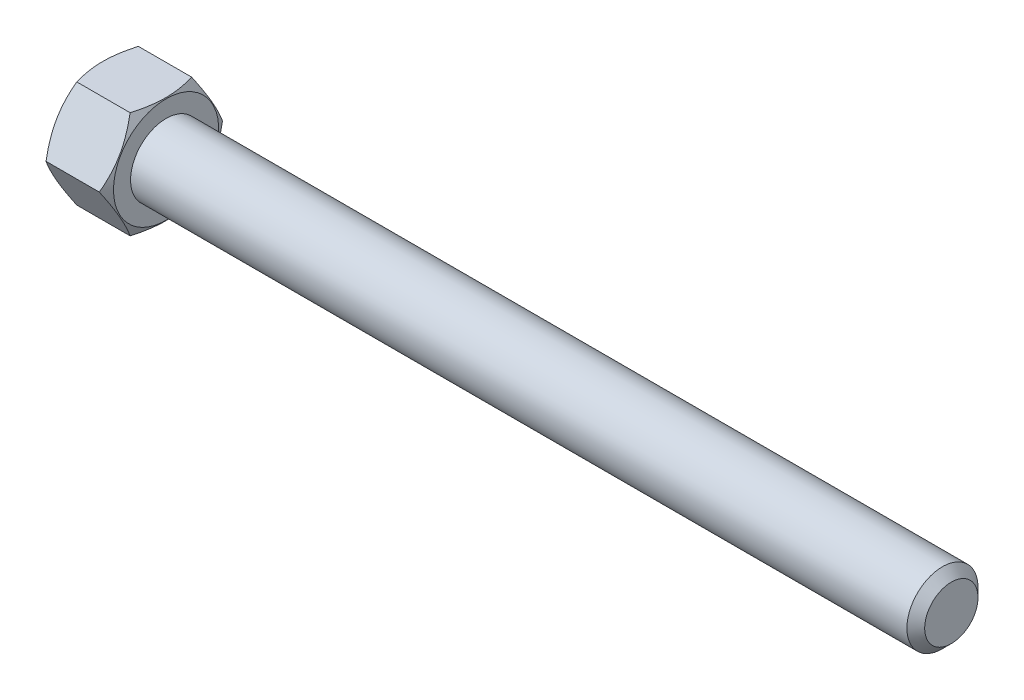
ISO-10303-21;
HEADER;
FILE_DESCRIPTION(('STEP AP214'),'2;1');
FILE_NAME('part.step','',(''),(''),'','','');
FILE_SCHEMA(('AUTOMOTIVE_DESIGN { 1 0 10303 214 1 1 1 1 }'));
ENDSEC;
DATA;
#1=APPLICATION_CONTEXT('core data for automotive mechanical design processes');
#2=APPLICATION_PROTOCOL_DEFINITION('international standard','automotive_design',2000,#1);
#3=PRODUCT_CONTEXT('',#1,'mechanical');
#4=PRODUCT('Part','Part','',(#3));
#5=PRODUCT_RELATED_PRODUCT_CATEGORY('part','',(#4));
#6=PRODUCT_DEFINITION_FORMATION('','',#4);
#7=PRODUCT_DEFINITION_CONTEXT('part definition',#1,'design');
#8=PRODUCT_DEFINITION('design','',#6,#7);
#9=PRODUCT_DEFINITION_SHAPE('','',#8);
#10=(LENGTH_UNIT() NAMED_UNIT(*) SI_UNIT(.MILLI.,.METRE.));
#11=(NAMED_UNIT(*) PLANE_ANGLE_UNIT() SI_UNIT($,.RADIAN.));
#12=(NAMED_UNIT(*) SI_UNIT($,.STERADIAN.) SOLID_ANGLE_UNIT());
#13=UNCERTAINTY_MEASURE_WITH_UNIT(LENGTH_MEASURE(1.E-05),#10,'distance_accuracy_value','');
#14=(GEOMETRIC_REPRESENTATION_CONTEXT(3) GLOBAL_UNCERTAINTY_ASSIGNED_CONTEXT((#13)) GLOBAL_UNIT_ASSIGNED_CONTEXT((#10,
#11,#12)) REPRESENTATION_CONTEXT('',''));
#15=CARTESIAN_POINT('',(0.,0.,0.));
#16=DIRECTION('',(0.,0.,1.));
#17=DIRECTION('',(1.,0.,0.));
#18=AXIS2_PLACEMENT_3D('',#15,#16,#17);
#19=CARTESIAN_POINT('',(21.5,-18.,10.3923048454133));
#20=DIRECTION('',(0.,-0.5,0.866025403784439));
#21=DIRECTION('',(0.,-0.866025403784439,-0.5));
#22=AXIS2_PLACEMENT_3D('',#19,#20,#21);
#23=PLANE('',#22);
#24=DIRECTION('',(-1.,0.,0.));
#25=VECTOR('',#24,1.);
#26=CARTESIAN_POINT('',(21.5,-18.,10.3923048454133));
#27=LINE('',#26,#25);
#28=CARTESIAN_POINT('',(19.75,-18.,10.3923048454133));
#29=VERTEX_POINT('',#28);
#30=CARTESIAN_POINT('',(1.75,-18.,10.3923048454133));
#31=VERTEX_POINT('',#30);
#32=EDGE_CURVE('E12',#29,#31,#27,.T.);
#33=ORIENTED_EDGE('',*,*,#32,.F.);
#34=CARTESIAN_POINT('',(19.7499333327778,-18.0002,10.3921893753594));
#35=CARTESIAN_POINT('',(19.8818017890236,-17.6045674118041,10.6206079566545));
#36=CARTESIAN_POINT('',(20.0076862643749,-17.2073916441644,10.8499174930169));
#37=CARTESIAN_POINT('',(20.2458239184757,-16.4098552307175,11.310375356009));
#38=CARTESIAN_POINT('',(20.3580726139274,-16.0094935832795,11.5415242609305));
#39=CARTESIAN_POINT('',(20.5674298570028,-15.2048116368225,12.0061075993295));
#40=CARTESIAN_POINT('',(20.6645025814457,-14.8004842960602,12.2395460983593));
#41=CARTESIAN_POINT('',(20.8414234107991,-13.9890201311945,12.7080451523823));
#42=CARTESIAN_POINT('',(20.921272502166,-13.5818834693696,12.9431056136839));
#43=CARTESIAN_POINT('',(21.0603498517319,-12.7752328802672,13.4088255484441));
#44=CARTESIAN_POINT('',(21.1200384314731,-12.3757788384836,13.6394504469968));
#45=CARTESIAN_POINT('',(21.2201227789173,-11.5750403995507,14.1017570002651));
#46=CARTESIAN_POINT('',(21.2605181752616,-11.1737559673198,14.3334386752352));
#47=CARTESIAN_POINT('',(21.3209961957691,-10.3705130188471,14.7971912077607));
#48=CARTESIAN_POINT('',(21.3411029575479,-9.96855587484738,15.0292612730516));
#49=CARTESIAN_POINT('',(21.3605713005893,-9.16427056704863,15.4936156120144));
#50=CARTESIAN_POINT('',(21.3599335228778,-8.76194241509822,15.7258998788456));
#51=CARTESIAN_POINT('',(21.3393615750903,-8.0097806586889,16.1601606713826));
#52=CARTESIAN_POINT('',(21.3219359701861,-7.65989346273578,16.3621681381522));
#53=CARTESIAN_POINT('',(21.2717260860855,-6.96095368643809,16.765701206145));
#54=CARTESIAN_POINT('',(21.2389420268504,-6.61190109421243,16.9672268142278));
#55=CARTESIAN_POINT('',(21.158584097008,-5.91476277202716,17.3697198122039));
#56=CARTESIAN_POINT('',(21.1109968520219,-5.56667820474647,17.5706865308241));
#57=CARTESIAN_POINT('',(21.0018722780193,-4.87216610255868,17.9716632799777));
#58=CARTESIAN_POINT('',(20.9403350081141,-4.52573856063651,18.1716733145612));
#59=CARTESIAN_POINT('',(20.7332330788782,-3.47411308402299,18.7788295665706));
#60=CARTESIAN_POINT('',(20.5670176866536,-2.77196054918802,19.1842175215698));
#61=CARTESIAN_POINT('',(20.1897769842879,-1.37812528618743,19.9889486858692));
#62=CARTESIAN_POINT('',(19.978840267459,-0.686424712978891,20.3883021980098));
#63=CARTESIAN_POINT('',(19.7499333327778,0.000199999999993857,20.7847251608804));
#64=B_SPLINE_CURVE_WITH_KNOTS('',3,(#34,#35,#36,#37,#38,#39,#40,#41,#42,#43,#44,#45,#46,#47,#48,
#49,#50,#51,#52,#53,#54,#55,#56,#57,#58,#59,#60,#61,#62,#63),.UNSPECIFIED.,.F.,.F.,(4,2,2,2,2,2,
2,2,2,2,2,2,2,2,4),(0.,1.42650335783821,2.85347447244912,4.28376471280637,5.71397301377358,
7.10888071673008,8.50381526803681,9.8970882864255,11.2903182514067,12.5031974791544,
13.7160593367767,14.9300201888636,16.1439758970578,18.6253607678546,21.1018751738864),.UNSPECIFIED.);
#65=CARTESIAN_POINT('',(19.75,0.,20.7846096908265));
#66=VERTEX_POINT('',#65);
#67=EDGE_CURVE('E100',#29,#66,#64,.T.);
#68=ORIENTED_EDGE('',*,*,#67,.T.);
#69=DIRECTION('',(-1.,0.,0.));
#70=VECTOR('',#69,1.);
#71=CARTESIAN_POINT('',(21.5,0.,20.7846096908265));
#72=LINE('',#71,#70);
#73=CARTESIAN_POINT('',(1.74999999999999,0.,20.7846096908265));
#74=VERTEX_POINT('',#73);
#75=EDGE_CURVE('E70',#66,#74,#72,.T.);
#76=ORIENTED_EDGE('',*,*,#75,.T.);
#77=CARTESIAN_POINT('',(1.75006666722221,0.000199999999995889,20.7847251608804));
#78=CARTESIAN_POINT('',(1.6181982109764,-0.395432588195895,20.5563065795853));
#79=CARTESIAN_POINT('',(1.49231373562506,-0.792608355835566,20.3269970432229));
#80=CARTESIAN_POINT('',(1.25417608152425,-1.59014476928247,19.8665391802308));
#81=CARTESIAN_POINT('',(1.1419273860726,-1.99050641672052,19.6353902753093));
#82=CARTESIAN_POINT('',(0.93257014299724,-2.79518836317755,19.1708069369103));
#83=CARTESIAN_POINT('',(0.835497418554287,-3.19951570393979,18.9373684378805));
#84=CARTESIAN_POINT('',(0.65857658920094,-4.01097986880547,18.4688693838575));
#85=CARTESIAN_POINT('',(0.578727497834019,-4.41811653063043,18.2338089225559));
#86=CARTESIAN_POINT('',(0.439650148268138,-5.22476711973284,17.7680889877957));
#87=CARTESIAN_POINT('',(0.379961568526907,-5.62422116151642,17.537464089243));
#88=CARTESIAN_POINT('',(0.27987722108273,-6.42495960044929,17.0751575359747));
#89=CARTESIAN_POINT('',(0.239481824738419,-6.82624403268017,16.8434758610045));
#90=CARTESIAN_POINT('',(0.179003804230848,-7.62948698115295,16.3797233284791));
#91=CARTESIAN_POINT('',(0.158897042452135,-8.03144412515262,16.1476532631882));
#92=CARTESIAN_POINT('',(0.139428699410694,-8.83572943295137,15.6832989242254));
#93=CARTESIAN_POINT('',(0.14006647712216,-9.23805758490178,15.4510146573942));
#94=CARTESIAN_POINT('',(0.160638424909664,-9.99021934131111,15.0167538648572));
#95=CARTESIAN_POINT('',(0.178064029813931,-10.3401065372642,14.8147463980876));
#96=CARTESIAN_POINT('',(0.228273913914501,-11.0390463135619,14.4112133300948));
#97=CARTESIAN_POINT('',(0.261057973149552,-11.3880989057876,14.209687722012));
#98=CARTESIAN_POINT('',(0.341415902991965,-12.0852372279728,13.8071947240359));
#99=CARTESIAN_POINT('',(0.38900314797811,-12.4333217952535,13.6062280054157));
#100=CARTESIAN_POINT('',(0.49812772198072,-13.1278338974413,13.2052512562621));
#101=CARTESIAN_POINT('',(0.559664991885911,-13.4742614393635,13.0052412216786));
#102=CARTESIAN_POINT('',(0.766766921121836,-14.525886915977,12.3980849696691));
#103=CARTESIAN_POINT('',(0.932982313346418,-15.228039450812,11.99269701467));
#104=CARTESIAN_POINT('',(1.31022301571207,-16.6218747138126,11.1879658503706));
#105=CARTESIAN_POINT('',(1.52115973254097,-17.3135752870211,10.78861233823));
#106=CARTESIAN_POINT('',(1.75006666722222,-18.0002,10.3921893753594));
#107=B_SPLINE_CURVE_WITH_KNOTS('',3,(#77,#78,#79,#80,#81,#82,#83,#84,#85,#86,#87,#88,#89,#90,
#91,#92,#93,#94,#95,#96,#97,#98,#99,#100,#101,#102,#103,#104,#105,#106),.UNSPECIFIED.,.F.,.F.,
(4,2,2,2,2,2,2,2,2,2,2,2,2,2,4),(0.,1.42650335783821,2.85347447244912,4.28376471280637,
5.71397301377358,7.10888071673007,8.5038152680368,9.89708828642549,11.2903182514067,
12.5031974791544,13.7160593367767,14.9300201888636,16.1439758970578,18.6253607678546,
21.1018751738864),.UNSPECIFIED.);
#108=EDGE_CURVE('E115',#74,#31,#107,.T.);
#109=ORIENTED_EDGE('',*,*,#108,.T.);
#110=EDGE_LOOP('',(#33,#68,#76,#109));
#111=FACE_BOUND('',#110,.T.);
#112=ADVANCED_FACE('F45',(#111),#23,.T.);
#113=CARTESIAN_POINT('',(21.5,-18.,-10.3923048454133));
#114=DIRECTION('',(0.,-1.,0.));
#115=DIRECTION('',(0.,0.,-1.));
#116=AXIS2_PLACEMENT_3D('',#113,#114,#115);
#117=PLANE('',#116);
#118=DIRECTION('',(-1.,0.,0.));
#119=VECTOR('',#118,1.);
#120=CARTESIAN_POINT('',(21.5,-18.,-10.3923048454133));
#121=LINE('',#120,#119);
#122=CARTESIAN_POINT('',(19.75,-18.,-10.3923048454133));
#123=VERTEX_POINT('',#122);
#124=CARTESIAN_POINT('',(1.75,-18.,-10.3923048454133));
#125=VERTEX_POINT('',#124);
#126=EDGE_CURVE('E54',#123,#125,#121,.T.);
#127=ORIENTED_EDGE('',*,*,#126,.F.);
#128=CARTESIAN_POINT('',(12.7537522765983,-18.,-27.5421909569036));
#129=CARTESIAN_POINT('',(12.9446772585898,-18.,-27.1471314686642));
#130=CARTESIAN_POINT('',(13.1346125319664,-18.,-26.7515939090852));
#131=CARTESIAN_POINT('',(13.5122764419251,-18.,-25.9594616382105));
#132=CARTESIAN_POINT('',(13.7000050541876,-18.,-25.5628669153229));
#133=CARTESIAN_POINT('',(14.2595945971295,-18.,-24.371229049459));
#134=CARTESIAN_POINT('',(14.6277968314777,-18.,-23.5744609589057));
#135=CARTESIAN_POINT('',(15.354174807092,-18.,-21.9708426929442));
#136=CARTESIAN_POINT('',(15.7122809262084,-18.,-21.1639609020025));
#137=CARTESIAN_POINT('',(16.4130893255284,-18.,-19.5435589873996));
#138=CARTESIAN_POINT('',(16.7557924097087,-18.,-18.7300392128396));
#139=CARTESIAN_POINT('',(17.4257190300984,-18.,-17.0850605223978));
#140=CARTESIAN_POINT('',(17.7527035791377,-18.,-16.2535037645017));
#141=CARTESIAN_POINT('',(18.3810151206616,-18.,-14.5805692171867));
#142=CARTESIAN_POINT('',(18.6823392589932,-18.,-13.7391903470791));
#143=CARTESIAN_POINT('',(19.251215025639,-18.,-12.0470354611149));
#144=CARTESIAN_POINT('',(19.5188386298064,-18.,-11.1962838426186));
#145=CARTESIAN_POINT('',(20.0116221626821,-18.,-9.48260466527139));
#146=CARTESIAN_POINT('',(20.2367955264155,-18.,-8.61968105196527));
#147=CARTESIAN_POINT('',(20.5344662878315,-18.,-7.3160012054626));
#148=CARTESIAN_POINT('',(20.6270242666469,-18.,-6.87979525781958));
#149=CARTESIAN_POINT('',(20.7973129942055,-18.,-6.00448416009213));
#150=CARTESIAN_POINT('',(20.8750440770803,-18.,-5.565379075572));
#151=CARTESIAN_POINT('',(21.0142998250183,-18.,-4.68456586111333));
#152=CARTESIAN_POINT('',(21.0758234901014,-18.,-4.24285757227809));
#153=CARTESIAN_POINT('',(21.1814280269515,-18.,-3.35734567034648));
#154=CARTESIAN_POINT('',(21.2255088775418,-18.,-2.91354205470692));
#155=CARTESIAN_POINT('',(21.2950421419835,-18.,-2.0272925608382));
#156=CARTESIAN_POINT('',(21.3206106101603,-18.,-1.58485584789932));
#157=CARTESIAN_POINT('',(21.3529849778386,-18.,-0.699298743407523));
#158=CARTESIAN_POINT('',(21.3597911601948,-18.,-0.256178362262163));
#159=CARTESIAN_POINT('',(21.3544796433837,-18.,0.629828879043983));
#160=CARTESIAN_POINT('',(21.3423671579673,-18.,1.07271576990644));
#161=CARTESIAN_POINT('',(21.2995189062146,-18.,1.95758964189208));
#162=CARTESIAN_POINT('',(21.2687823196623,-18.,2.39957658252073));
#163=CARTESIAN_POINT('',(21.1723280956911,-18.,3.47112769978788));
#164=CARTESIAN_POINT('',(21.0972625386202,-18.,4.09986678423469));
#165=CARTESIAN_POINT('',(20.9136280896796,-18.,5.35240621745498));
#166=CARTESIAN_POINT('',(20.8050542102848,-18.,5.97620581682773));
#167=CARTESIAN_POINT('',(20.4345174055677,-18.,7.84129017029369));
#168=CARTESIAN_POINT('',(20.1279866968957,-18.,9.07382231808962));
#169=CARTESIAN_POINT('',(19.5995943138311,-18.,10.9174460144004));
#170=CARTESIAN_POINT('',(19.4094517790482,-18.,11.5381742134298));
#171=CARTESIAN_POINT('',(19.0102504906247,-18.,12.7736336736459));
#172=CARTESIAN_POINT('',(18.8011900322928,-18.,13.3883643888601));
#173=CARTESIAN_POINT('',(18.3686043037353,-18.,14.6087639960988));
#174=CARTESIAN_POINT('',(18.1451673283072,-18.,15.214464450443));
#175=CARTESIAN_POINT('',(17.8003584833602,-18.,16.1192027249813));
#176=CARTESIAN_POINT('',(17.6838330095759,-18.,16.4200981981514));
#177=CARTESIAN_POINT('',(17.4478255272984,-18.,17.0207210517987));
#178=CARTESIAN_POINT('',(17.3283435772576,-18.,17.3204484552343));
#179=CARTESIAN_POINT('',(17.2075168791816,-18.,17.6196324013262));
#180=B_SPLINE_CURVE_WITH_KNOTS('',3,(#128,#129,#130,#131,#132,#133,#134,#135,#136,#137,#138,
#139,#140,#141,#142,#143,#144,#145,#146,#147,#148,#149,#150,#151,#152,#153,#154,#155,#156,#157,
#158,#159,#160,#161,#162,#163,#164,#165,#166,#167,#168,#169,#170,#171,#172,#173,#174,#175,#176,
#177,#178,#179),.UNSPECIFIED.,.F.,.F.,(4,2,2,2,2,2,2,2,2,2,2,2,2,2,2,2,2,2,2,2,2,2,2,2,2,4),(0.,
1.31632532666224,2.6326651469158,5.26577398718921,7.91398554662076,10.562058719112,
13.2423415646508,15.9229221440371,18.5976769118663,21.2715837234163,22.609125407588,
23.9466369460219,25.2842309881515,26.6218266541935,27.950962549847,29.2800784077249,
30.6088280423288,31.9376362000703,33.8361701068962,35.7349867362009,39.5399393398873,
41.4873802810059,43.4349968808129,45.3716216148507,46.3396196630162,47.3075985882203),.UNSPECIFIED.);
#181=EDGE_CURVE('E108',#123,#29,#180,.T.);
#182=ORIENTED_EDGE('',*,*,#181,.T.);
#183=ORIENTED_EDGE('',*,*,#32,.T.);
#184=CARTESIAN_POINT('',(8.74624772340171,-18.,-27.5421909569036));
#185=CARTESIAN_POINT('',(8.55532274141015,-18.,-27.1471314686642));
#186=CARTESIAN_POINT('',(8.3653874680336,-18.,-26.7515939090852));
#187=CARTESIAN_POINT('',(7.98772355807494,-18.,-25.9594616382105));
#188=CARTESIAN_POINT('',(7.79999494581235,-18.,-25.5628669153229));
#189=CARTESIAN_POINT('',(7.24040540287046,-18.,-24.371229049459));
#190=CARTESIAN_POINT('',(6.87220316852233,-18.,-23.5744609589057));
#191=CARTESIAN_POINT('',(6.145825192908,-18.,-21.9708426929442));
#192=CARTESIAN_POINT('',(5.78771907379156,-18.,-21.1639609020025));
#193=CARTESIAN_POINT('',(5.08691067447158,-18.,-19.5435589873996));
#194=CARTESIAN_POINT('',(4.74420759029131,-18.,-18.7300392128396));
#195=CARTESIAN_POINT('',(4.0742809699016,-18.,-17.0850605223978));
#196=CARTESIAN_POINT('',(3.74729642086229,-18.,-16.2535037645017));
#197=CARTESIAN_POINT('',(3.11898487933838,-18.,-14.5805692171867));
#198=CARTESIAN_POINT('',(2.81766074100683,-18.,-13.7391903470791));
#199=CARTESIAN_POINT('',(2.24878497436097,-18.,-12.0470354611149));
#200=CARTESIAN_POINT('',(1.98116137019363,-18.,-11.1962838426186));
#201=CARTESIAN_POINT('',(1.48837783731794,-18.,-9.48260466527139));
#202=CARTESIAN_POINT('',(1.26320447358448,-18.,-8.61968105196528));
#203=CARTESIAN_POINT('',(0.965533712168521,-18.,-7.3160012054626));
#204=CARTESIAN_POINT('',(0.872975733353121,-18.,-6.87979525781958));
#205=CARTESIAN_POINT('',(0.702687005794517,-18.,-6.00448416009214));
#206=CARTESIAN_POINT('',(0.624955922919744,-18.,-5.565379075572));
#207=CARTESIAN_POINT('',(0.485700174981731,-18.,-4.68456586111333));
#208=CARTESIAN_POINT('',(0.424176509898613,-18.,-4.24285757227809));
#209=CARTESIAN_POINT('',(0.318571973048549,-18.,-3.35734567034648));
#210=CARTESIAN_POINT('',(0.274491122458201,-18.,-2.91354205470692));
#211=CARTESIAN_POINT('',(0.204957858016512,-18.,-2.02729256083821));
#212=CARTESIAN_POINT('',(0.179389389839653,-18.,-1.58485584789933));
#213=CARTESIAN_POINT('',(0.147015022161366,-18.,-0.699298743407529));
#214=CARTESIAN_POINT('',(0.140208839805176,-18.,-0.256178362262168));
#215=CARTESIAN_POINT('',(0.14552035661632,-18.,0.62982887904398));
#216=CARTESIAN_POINT('',(0.157632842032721,-18.,1.07271576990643));
#217=CARTESIAN_POINT('',(0.200481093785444,-18.,1.95758964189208));
#218=CARTESIAN_POINT('',(0.231217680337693,-18.,2.39957658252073));
#219=CARTESIAN_POINT('',(0.327671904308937,-18.,3.47112769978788));
#220=CARTESIAN_POINT('',(0.402737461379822,-18.,4.09986678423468));
#221=CARTESIAN_POINT('',(0.586371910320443,-18.,5.35240621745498));
#222=CARTESIAN_POINT('',(0.694945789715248,-18.,5.97620581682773));
#223=CARTESIAN_POINT('',(1.06548259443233,-18.,7.84129017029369));
#224=CARTESIAN_POINT('',(1.3720133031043,-18.,9.07382231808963));
#225=CARTESIAN_POINT('',(1.90040568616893,-18.,10.9174460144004));
#226=CARTESIAN_POINT('',(2.09054822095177,-18.,11.5381742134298));
#227=CARTESIAN_POINT('',(2.48974950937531,-18.,12.773633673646));
#228=CARTESIAN_POINT('',(2.69880996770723,-18.,13.3883643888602));
#229=CARTESIAN_POINT('',(3.13139569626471,-18.,14.6087639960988));
#230=CARTESIAN_POINT('',(3.35483267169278,-18.,15.214464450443));
#231=CARTESIAN_POINT('',(3.69964151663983,-18.,16.1192027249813));
#232=CARTESIAN_POINT('',(3.81616699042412,-18.,16.4200981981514));
#233=CARTESIAN_POINT('',(4.05217447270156,-18.,17.0207210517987));
#234=CARTESIAN_POINT('',(4.17165642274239,-18.,17.3204484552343));
#235=CARTESIAN_POINT('',(4.29248312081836,-18.,17.6196324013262));
#236=B_SPLINE_CURVE_WITH_KNOTS('',3,(#184,#185,#186,#187,#188,#189,#190,#191,#192,#193,#194,
#195,#196,#197,#198,#199,#200,#201,#202,#203,#204,#205,#206,#207,#208,#209,#210,#211,#212,#213,
#214,#215,#216,#217,#218,#219,#220,#221,#222,#223,#224,#225,#226,#227,#228,#229,#230,#231,#232,
#233,#234,#235),.UNSPECIFIED.,.F.,.F.,(4,2,2,2,2,2,2,2,2,2,2,2,2,2,2,2,2,2,2,2,2,2,2,2,2,4),(0.,
1.31632532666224,2.6326651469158,5.2657739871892,7.91398554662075,10.562058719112,
13.2423415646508,15.9229221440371,18.5976769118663,21.2715837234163,22.609125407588,
23.9466369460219,25.2842309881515,26.6218266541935,27.950962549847,29.2800784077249,
30.6088280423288,31.9376362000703,33.8361701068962,35.7349867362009,39.5399393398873,
41.4873802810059,43.4349968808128,45.3716216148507,46.3396196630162,47.3075985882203),.UNSPECIFIED.);
#237=EDGE_CURVE('E118',#31,#125,#236,.F.);
#238=ORIENTED_EDGE('',*,*,#237,.T.);
#239=EDGE_LOOP('',(#127,#182,#183,#238));
#240=FACE_BOUND('',#239,.T.);
#241=ADVANCED_FACE('F176',(#240),#117,.T.);
#242=CARTESIAN_POINT('',(21.5,0.,-20.7846096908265));
#243=DIRECTION('',(0.,-0.5,-0.866025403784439));
#244=DIRECTION('',(0.,0.866025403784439,-0.5));
#245=AXIS2_PLACEMENT_3D('',#242,#243,#244);
#246=PLANE('',#245);
#247=DIRECTION('',(-1.,0.,0.));
#248=VECTOR('',#247,1.);
#249=CARTESIAN_POINT('',(21.5,0.,-20.7846096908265));
#250=LINE('',#249,#248);
#251=CARTESIAN_POINT('',(19.75,0.,-20.7846096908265));
#252=VERTEX_POINT('',#251);
#253=CARTESIAN_POINT('',(1.75,0.,-20.7846096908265));
#254=VERTEX_POINT('',#253);
#255=EDGE_CURVE('E122',#252,#254,#250,.T.);
#256=ORIENTED_EDGE('',*,*,#255,.F.);
#257=CARTESIAN_POINT('',(19.7499333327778,0.000199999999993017,-20.7847251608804));
#258=CARTESIAN_POINT('',(19.8818017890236,-0.395432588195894,-20.5563065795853));
#259=CARTESIAN_POINT('',(20.0076862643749,-0.792608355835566,-20.3269970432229));
#260=CARTESIAN_POINT('',(20.2458239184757,-1.59014476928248,-19.8665391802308));
#261=CARTESIAN_POINT('',(20.3580726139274,-1.99050641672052,-19.6353902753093));
#262=CARTESIAN_POINT('',(20.5674298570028,-2.79518836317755,-19.1708069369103));
#263=CARTESIAN_POINT('',(20.6645025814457,-3.19951570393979,-18.9373684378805));
#264=CARTESIAN_POINT('',(20.841423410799,-4.01097986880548,-18.4688693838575));
#265=CARTESIAN_POINT('',(20.921272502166,-4.41811653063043,-18.2338089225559));
#266=CARTESIAN_POINT('',(21.0603498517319,-5.22476711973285,-17.7680889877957));
#267=CARTESIAN_POINT('',(21.1200384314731,-5.62422116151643,-17.537464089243));
#268=CARTESIAN_POINT('',(21.2201227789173,-6.42495960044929,-17.0751575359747));
#269=CARTESIAN_POINT('',(21.2605181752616,-6.82624403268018,-16.8434758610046));
#270=CARTESIAN_POINT('',(21.3209961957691,-7.62948698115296,-16.3797233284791));
#271=CARTESIAN_POINT('',(21.3411029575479,-8.03144412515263,-16.1476532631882));
#272=CARTESIAN_POINT('',(21.3605713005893,-8.83572943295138,-15.6832989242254));
#273=CARTESIAN_POINT('',(21.3599335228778,-9.23805758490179,-15.4510146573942));
#274=CARTESIAN_POINT('',(21.3393615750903,-9.99021934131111,-15.0167538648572));
#275=CARTESIAN_POINT('',(21.3219359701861,-10.3401065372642,-14.8147463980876));
#276=CARTESIAN_POINT('',(21.2717260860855,-11.0390463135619,-14.4112133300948));
#277=CARTESIAN_POINT('',(21.2389420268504,-11.3880989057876,-14.209687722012));
#278=CARTESIAN_POINT('',(21.158584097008,-12.0852372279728,-13.8071947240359));
#279=CARTESIAN_POINT('',(21.1109968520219,-12.4333217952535,-13.6062280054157));
#280=CARTESIAN_POINT('',(21.0018722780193,-13.1278338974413,-13.2052512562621));
#281=CARTESIAN_POINT('',(20.9403350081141,-13.4742614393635,-13.0052412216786));
#282=CARTESIAN_POINT('',(20.7332330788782,-14.525886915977,-12.3980849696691));
#283=CARTESIAN_POINT('',(20.5670176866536,-15.228039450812,-11.99269701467));
#284=CARTESIAN_POINT('',(20.1897769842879,-16.6218747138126,-11.1879658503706));
#285=CARTESIAN_POINT('',(19.978840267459,-17.3135752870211,-10.78861233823));
#286=CARTESIAN_POINT('',(19.7499333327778,-18.0002,-10.3921893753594));
#287=B_SPLINE_CURVE_WITH_KNOTS('',3,(#257,#258,#259,#260,#261,#262,#263,#264,#265,#266,#267,
#268,#269,#270,#271,#272,#273,#274,#275,#276,#277,#278,#279,#280,#281,#282,#283,#284,#285,#286),
.UNSPECIFIED.,.F.,.F.,(4,2,2,2,2,2,2,2,2,2,2,2,2,2,4),(0.,1.42650335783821,2.85347447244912,
4.28376471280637,5.71397301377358,7.10888071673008,8.5038152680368,9.89708828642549,
11.2903182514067,12.5031974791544,13.7160593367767,14.9300201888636,16.1439758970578,
18.6253607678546,21.1018751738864),.UNSPECIFIED.);
#288=EDGE_CURVE('E182',#252,#123,#287,.T.);
#289=ORIENTED_EDGE('',*,*,#288,.T.);
#290=ORIENTED_EDGE('',*,*,#126,.T.);
#291=CARTESIAN_POINT('',(1.75006666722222,-18.0002,-10.3921893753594));
#292=CARTESIAN_POINT('',(1.61819821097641,-17.6045674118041,-10.6206079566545));
#293=CARTESIAN_POINT('',(1.49231373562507,-17.2073916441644,-10.8499174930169));
#294=CARTESIAN_POINT('',(1.25417608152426,-16.4098552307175,-11.310375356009));
#295=CARTESIAN_POINT('',(1.14192738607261,-16.0094935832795,-11.5415242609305));
#296=CARTESIAN_POINT('',(0.932570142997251,-15.2048116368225,-12.0061075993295));
#297=CARTESIAN_POINT('',(0.835497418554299,-14.8004842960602,-12.2395460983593));
#298=CARTESIAN_POINT('',(0.658576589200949,-13.9890201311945,-12.7080451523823));
#299=CARTESIAN_POINT('',(0.578727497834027,-13.5818834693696,-12.9431056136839));
#300=CARTESIAN_POINT('',(0.439650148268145,-12.7752328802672,-13.4088255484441));
#301=CARTESIAN_POINT('',(0.379961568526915,-12.3757788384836,-13.6394504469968));
#302=CARTESIAN_POINT('',(0.279877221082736,-11.5750403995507,-14.1017570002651));
#303=CARTESIAN_POINT('',(0.239481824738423,-11.1737559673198,-14.3334386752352));
#304=CARTESIAN_POINT('',(0.179003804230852,-10.3705130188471,-14.7971912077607));
#305=CARTESIAN_POINT('',(0.15889704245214,-9.96855587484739,-15.0292612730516));
#306=CARTESIAN_POINT('',(0.1394286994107,-9.16427056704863,-15.4936156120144));
#307=CARTESIAN_POINT('',(0.140066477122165,-8.76194241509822,-15.7258998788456));
#308=CARTESIAN_POINT('',(0.160638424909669,-8.0097806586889,-16.1601606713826));
#309=CARTESIAN_POINT('',(0.178064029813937,-7.65989346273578,-16.3621681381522));
#310=CARTESIAN_POINT('',(0.228273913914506,-6.96095368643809,-16.765701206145));
#311=CARTESIAN_POINT('',(0.261057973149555,-6.61190109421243,-16.9672268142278));
#312=CARTESIAN_POINT('',(0.341415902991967,-5.91476277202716,-17.3697198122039));
#313=CARTESIAN_POINT('',(0.389003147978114,-5.56667820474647,-17.5706865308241));
#314=CARTESIAN_POINT('',(0.498127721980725,-4.87216610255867,-17.9716632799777));
#315=CARTESIAN_POINT('',(0.559664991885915,-4.52573856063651,-18.1716733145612));
#316=CARTESIAN_POINT('',(0.766766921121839,-3.47411308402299,-18.7788295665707));
#317=CARTESIAN_POINT('',(0.93298231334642,-2.77196054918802,-19.1842175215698));
#318=CARTESIAN_POINT('',(1.31022301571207,-1.37812528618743,-19.9889486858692));
#319=CARTESIAN_POINT('',(1.52115973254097,-0.686424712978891,-20.3883021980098));
#320=CARTESIAN_POINT('',(1.75006666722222,0.000199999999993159,-20.7847251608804));
#321=B_SPLINE_CURVE_WITH_KNOTS('',3,(#291,#292,#293,#294,#295,#296,#297,#298,#299,#300,#301,
#302,#303,#304,#305,#306,#307,#308,#309,#310,#311,#312,#313,#314,#315,#316,#317,#318,#319,#320),
.UNSPECIFIED.,.F.,.F.,(4,2,2,2,2,2,2,2,2,2,2,2,2,2,4),(0.,1.42650335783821,2.85347447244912,
4.28376471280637,5.71397301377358,7.10888071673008,8.5038152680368,9.89708828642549,
11.2903182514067,12.5031974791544,13.7160593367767,14.9300201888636,16.1439758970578,
18.6253607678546,21.1018751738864),.UNSPECIFIED.);
#322=EDGE_CURVE('E166',#125,#254,#321,.T.);
#323=ORIENTED_EDGE('',*,*,#322,.T.);
#324=EDGE_LOOP('',(#256,#289,#290,#323));
#325=FACE_BOUND('',#324,.T.);
#326=ADVANCED_FACE('F172',(#325),#246,.T.);
#327=CARTESIAN_POINT('',(21.5,18.,-10.3923048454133));
#328=DIRECTION('',(0.,0.5,-0.866025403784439));
#329=DIRECTION('',(0.,0.866025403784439,0.5));
#330=AXIS2_PLACEMENT_3D('',#327,#328,#329);
#331=PLANE('',#330);
#332=DIRECTION('',(-1.,0.,0.));
#333=VECTOR('',#332,1.);
#334=CARTESIAN_POINT('',(21.5,18.,-10.3923048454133));
#335=LINE('',#334,#333);
#336=CARTESIAN_POINT('',(19.75,18.,-10.3923048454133));
#337=VERTEX_POINT('',#336);
#338=CARTESIAN_POINT('',(1.75,18.,-10.3923048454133));
#339=VERTEX_POINT('',#338);
#340=EDGE_CURVE('E116',#337,#339,#335,.T.);
#341=ORIENTED_EDGE('',*,*,#340,.F.);
#342=CARTESIAN_POINT('',(19.7499333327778,18.0002,-10.3921893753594));
#343=CARTESIAN_POINT('',(19.8818017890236,17.6045674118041,-10.6206079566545));
#344=CARTESIAN_POINT('',(20.0076862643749,17.2073916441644,-10.8499174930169));
#345=CARTESIAN_POINT('',(20.2458239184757,16.4098552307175,-11.310375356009));
#346=CARTESIAN_POINT('',(20.3580726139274,16.0094935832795,-11.5415242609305));
#347=CARTESIAN_POINT('',(20.5674298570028,15.2048116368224,-12.0061075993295));
#348=CARTESIAN_POINT('',(20.6645025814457,14.8004842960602,-12.2395460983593));
#349=CARTESIAN_POINT('',(20.8414234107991,13.9890201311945,-12.7080451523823));
#350=CARTESIAN_POINT('',(20.921272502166,13.5818834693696,-12.9431056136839));
#351=CARTESIAN_POINT('',(21.0603498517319,12.7752328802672,-13.4088255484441));
#352=CARTESIAN_POINT('',(21.1200384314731,12.3757788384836,-13.6394504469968));
#353=CARTESIAN_POINT('',(21.2201227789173,11.5750403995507,-14.1017570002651));
#354=CARTESIAN_POINT('',(21.2605181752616,11.1737559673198,-14.3334386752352));
#355=CARTESIAN_POINT('',(21.3209961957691,10.370513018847,-14.7971912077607));
#356=CARTESIAN_POINT('',(21.3411029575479,9.96855587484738,-15.0292612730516));
#357=CARTESIAN_POINT('',(21.3605713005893,9.16427056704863,-15.4936156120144));
#358=CARTESIAN_POINT('',(21.3599335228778,8.76194241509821,-15.7258998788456));
#359=CARTESIAN_POINT('',(21.3393615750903,8.00978065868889,-16.1601606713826));
#360=CARTESIAN_POINT('',(21.3219359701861,7.65989346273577,-16.3621681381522));
#361=CARTESIAN_POINT('',(21.2717260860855,6.96095368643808,-16.765701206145));
#362=CARTESIAN_POINT('',(21.2389420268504,6.61190109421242,-16.9672268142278));
#363=CARTESIAN_POINT('',(21.158584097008,5.91476277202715,-17.3697198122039));
#364=CARTESIAN_POINT('',(21.1109968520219,5.56667820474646,-17.5706865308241));
#365=CARTESIAN_POINT('',(21.0018722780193,4.87216610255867,-17.9716632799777));
#366=CARTESIAN_POINT('',(20.9403350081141,4.5257385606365,-18.1716733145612));
#367=CARTESIAN_POINT('',(20.7332330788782,3.47411308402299,-18.7788295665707));
#368=CARTESIAN_POINT('',(20.5670176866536,2.77196054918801,-19.1842175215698));
#369=CARTESIAN_POINT('',(20.1897769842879,1.37812528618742,-19.9889486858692));
#370=CARTESIAN_POINT('',(19.978840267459,0.68642471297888,-20.3883021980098));
#371=CARTESIAN_POINT('',(19.7499333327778,-0.000200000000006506,-20.7847251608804));
#372=B_SPLINE_CURVE_WITH_KNOTS('',3,(#342,#343,#344,#345,#346,#347,#348,#349,#350,#351,#352,
#353,#354,#355,#356,#357,#358,#359,#360,#361,#362,#363,#364,#365,#366,#367,#368,#369,#370,#371),
.UNSPECIFIED.,.F.,.F.,(4,2,2,2,2,2,2,2,2,2,2,2,2,2,4),(0.,1.42650335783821,2.85347447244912,
4.28376471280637,5.71397301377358,7.10888071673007,8.5038152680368,9.89708828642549,
11.2903182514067,12.5031974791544,13.7160593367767,14.9300201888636,16.1439758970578,
18.6253607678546,21.1018751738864),.UNSPECIFIED.);
#373=EDGE_CURVE('E189',#337,#252,#372,.T.);
#374=ORIENTED_EDGE('',*,*,#373,.T.);
#375=ORIENTED_EDGE('',*,*,#255,.T.);
#376=CARTESIAN_POINT('',(1.75006666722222,-0.000200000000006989,-20.7847251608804));
#377=CARTESIAN_POINT('',(1.6181982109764,0.395432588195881,-20.5563065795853));
#378=CARTESIAN_POINT('',(1.49231373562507,0.792608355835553,-20.3269970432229));
#379=CARTESIAN_POINT('',(1.25417608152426,1.59014476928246,-19.8665391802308));
#380=CARTESIAN_POINT('',(1.14192738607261,1.99050641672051,-19.6353902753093));
#381=CARTESIAN_POINT('',(0.932570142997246,2.79518836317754,-19.1708069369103));
#382=CARTESIAN_POINT('',(0.835497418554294,3.19951570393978,-18.9373684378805));
#383=CARTESIAN_POINT('',(0.658576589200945,4.01097986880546,-18.4688693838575));
#384=CARTESIAN_POINT('',(0.578727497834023,4.41811653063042,-18.2338089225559));
#385=CARTESIAN_POINT('',(0.439650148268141,5.22476711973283,-17.7680889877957));
#386=CARTESIAN_POINT('',(0.379961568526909,5.62422116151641,-17.537464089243));
#387=CARTESIAN_POINT('',(0.279877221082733,6.42495960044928,-17.0751575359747));
#388=CARTESIAN_POINT('',(0.239481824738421,6.82624403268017,-16.8434758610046));
#389=CARTESIAN_POINT('',(0.17900380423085,7.62948698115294,-16.3797233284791));
#390=CARTESIAN_POINT('',(0.158897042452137,8.03144412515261,-16.1476532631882));
#391=CARTESIAN_POINT('',(0.139428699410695,8.83572943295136,-15.6832989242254));
#392=CARTESIAN_POINT('',(0.14006647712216,9.23805758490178,-15.4510146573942));
#393=CARTESIAN_POINT('',(0.160638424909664,9.9902193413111,-15.0167538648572));
#394=CARTESIAN_POINT('',(0.178064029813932,10.3401065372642,-14.8147463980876));
#395=CARTESIAN_POINT('',(0.228273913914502,11.0390463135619,-14.4112133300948));
#396=CARTESIAN_POINT('',(0.261057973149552,11.3880989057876,-14.209687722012));
#397=CARTESIAN_POINT('',(0.341415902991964,12.0852372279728,-13.8071947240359));
#398=CARTESIAN_POINT('',(0.389003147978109,12.4333217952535,-13.6062280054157));
#399=CARTESIAN_POINT('',(0.498127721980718,13.1278338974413,-13.2052512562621));
#400=CARTESIAN_POINT('',(0.559664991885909,13.4742614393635,-13.0052412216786));
#401=CARTESIAN_POINT('',(0.766766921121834,14.525886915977,-12.3980849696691));
#402=CARTESIAN_POINT('',(0.932982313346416,15.228039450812,-11.99269701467));
#403=CARTESIAN_POINT('',(1.31022301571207,16.6218747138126,-11.1879658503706));
#404=CARTESIAN_POINT('',(1.52115973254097,17.3135752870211,-10.78861233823));
#405=CARTESIAN_POINT('',(1.75006666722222,18.0002,-10.3921893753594));
#406=B_SPLINE_CURVE_WITH_KNOTS('',3,(#376,#377,#378,#379,#380,#381,#382,#383,#384,#385,#386,
#387,#388,#389,#390,#391,#392,#393,#394,#395,#396,#397,#398,#399,#400,#401,#402,#403,#404,#405),
.UNSPECIFIED.,.F.,.F.,(4,2,2,2,2,2,2,2,2,2,2,2,2,2,4),(0.,1.42650335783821,2.85347447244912,
4.28376471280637,5.71397301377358,7.10888071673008,8.5038152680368,9.89708828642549,
11.2903182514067,12.5031974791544,13.7160593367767,14.9300201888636,16.1439758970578,
18.6253607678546,21.1018751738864),.UNSPECIFIED.);
#407=EDGE_CURVE('E161',#254,#339,#406,.T.);
#408=ORIENTED_EDGE('',*,*,#407,.T.);
#409=EDGE_LOOP('',(#341,#374,#375,#408));
#410=FACE_BOUND('',#409,.T.);
#411=ADVANCED_FACE('F175',(#410),#331,.T.);
#412=CARTESIAN_POINT('',(21.5,18.,10.3923048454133));
#413=DIRECTION('',(0.,1.,0.));
#414=DIRECTION('',(0.,0.,1.));
#415=AXIS2_PLACEMENT_3D('',#412,#413,#414);
#416=PLANE('',#415);
#417=DIRECTION('',(-1.,0.,0.));
#418=VECTOR('',#417,1.);
#419=CARTESIAN_POINT('',(21.5,18.,10.3923048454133));
#420=LINE('',#419,#418);
#421=CARTESIAN_POINT('',(19.75,18.,10.3923048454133));
#422=VERTEX_POINT('',#421);
#423=CARTESIAN_POINT('',(1.75,18.,10.3923048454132));
#424=VERTEX_POINT('',#423);
#425=EDGE_CURVE('E114',#422,#424,#420,.T.);
#426=ORIENTED_EDGE('',*,*,#425,.F.);
#427=CARTESIAN_POINT('',(12.7537522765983,18.,-27.5421909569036));
#428=CARTESIAN_POINT('',(12.9446772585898,18.,-27.1471314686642));
#429=CARTESIAN_POINT('',(13.1346125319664,18.,-26.7515939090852));
#430=CARTESIAN_POINT('',(13.5122764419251,18.,-25.9594616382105));
#431=CARTESIAN_POINT('',(13.7000050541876,18.,-25.5628669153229));
#432=CARTESIAN_POINT('',(14.2595945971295,18.,-24.371229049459));
#433=CARTESIAN_POINT('',(14.6277968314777,18.,-23.5744609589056));
#434=CARTESIAN_POINT('',(15.354174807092,18.,-21.9708426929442));
#435=CARTESIAN_POINT('',(15.7122809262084,18.,-21.1639609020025));
#436=CARTESIAN_POINT('',(16.4130893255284,18.,-19.5435589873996));
#437=CARTESIAN_POINT('',(16.7557924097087,18.,-18.7300392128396));
#438=CARTESIAN_POINT('',(17.4257190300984,18.,-17.0850605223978));
#439=CARTESIAN_POINT('',(17.7527035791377,18.,-16.2535037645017));
#440=CARTESIAN_POINT('',(18.3810151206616,18.,-14.5805692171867));
#441=CARTESIAN_POINT('',(18.6823392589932,18.,-13.7391903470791));
#442=CARTESIAN_POINT('',(19.251215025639,18.,-12.0470354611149));
#443=CARTESIAN_POINT('',(19.5188386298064,18.,-11.1962838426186));
#444=CARTESIAN_POINT('',(20.0116221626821,18.,-9.48260466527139));
#445=CARTESIAN_POINT('',(20.2367955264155,18.,-8.61968105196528));
#446=CARTESIAN_POINT('',(20.5344662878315,18.,-7.31600120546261));
#447=CARTESIAN_POINT('',(20.6270242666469,18.,-6.87979525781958));
#448=CARTESIAN_POINT('',(20.7973129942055,18.,-6.00448416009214));
#449=CARTESIAN_POINT('',(20.8750440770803,18.,-5.56537907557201));
#450=CARTESIAN_POINT('',(21.0142998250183,18.,-4.68456586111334));
#451=CARTESIAN_POINT('',(21.0758234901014,18.,-4.2428575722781));
#452=CARTESIAN_POINT('',(21.1814280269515,18.,-3.35734567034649));
#453=CARTESIAN_POINT('',(21.2255088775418,18.,-2.91354205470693));
#454=CARTESIAN_POINT('',(21.2950421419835,18.,-2.02729256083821));
#455=CARTESIAN_POINT('',(21.3206106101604,18.,-1.58485584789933));
#456=CARTESIAN_POINT('',(21.3529849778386,18.,-0.699298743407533));
#457=CARTESIAN_POINT('',(21.3597911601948,18.,-0.256178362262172));
#458=CARTESIAN_POINT('',(21.3544796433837,18.,0.629828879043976));
#459=CARTESIAN_POINT('',(21.3423671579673,18.,1.07271576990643));
#460=CARTESIAN_POINT('',(21.2995189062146,18.,1.95758964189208));
#461=CARTESIAN_POINT('',(21.2687823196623,18.,2.39957658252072));
#462=CARTESIAN_POINT('',(21.1723280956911,18.,3.47112769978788));
#463=CARTESIAN_POINT('',(21.0972625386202,18.,4.09986678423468));
#464=CARTESIAN_POINT('',(20.9136280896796,18.,5.35240621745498));
#465=CARTESIAN_POINT('',(20.8050542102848,18.,5.97620581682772));
#466=CARTESIAN_POINT('',(20.4345174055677,18.,7.84129017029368));
#467=CARTESIAN_POINT('',(20.1279866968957,18.,9.07382231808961));
#468=CARTESIAN_POINT('',(19.5995943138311,18.,10.9174460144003));
#469=CARTESIAN_POINT('',(19.4094517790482,18.,11.5381742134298));
#470=CARTESIAN_POINT('',(19.0102504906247,18.,12.7736336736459));
#471=CARTESIAN_POINT('',(18.8011900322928,18.,13.3883643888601));
#472=CARTESIAN_POINT('',(18.3686043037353,18.,14.6087639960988));
#473=CARTESIAN_POINT('',(18.1451673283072,18.,15.2144644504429));
#474=CARTESIAN_POINT('',(17.8003584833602,18.,16.1192027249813));
#475=CARTESIAN_POINT('',(17.6838330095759,18.,16.4200981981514));
#476=CARTESIAN_POINT('',(17.4478255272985,18.,17.0207210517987));
#477=CARTESIAN_POINT('',(17.3283435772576,18.,17.3204484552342));
#478=CARTESIAN_POINT('',(17.2075168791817,18.,17.6196324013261));
#479=B_SPLINE_CURVE_WITH_KNOTS('',3,(#427,#428,#429,#430,#431,#432,#433,#434,#435,#436,#437,
#438,#439,#440,#441,#442,#443,#444,#445,#446,#447,#448,#449,#450,#451,#452,#453,#454,#455,#456,
#457,#458,#459,#460,#461,#462,#463,#464,#465,#466,#467,#468,#469,#470,#471,#472,#473,#474,#475,
#476,#477,#478),.UNSPECIFIED.,.F.,.F.,(4,2,2,2,2,2,2,2,2,2,2,2,2,2,2,2,2,2,2,2,2,2,2,2,2,4),(0.,
1.31632532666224,2.6326651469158,5.26577398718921,7.91398554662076,10.562058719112,
13.2423415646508,15.9229221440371,18.5976769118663,21.2715837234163,22.609125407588,
23.9466369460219,25.2842309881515,26.6218266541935,27.950962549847,29.2800784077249,
30.6088280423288,31.9376362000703,33.8361701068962,35.7349867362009,39.5399393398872,
41.4873802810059,43.4349968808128,45.3716216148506,46.3396196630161,47.3075985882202),.UNSPECIFIED.);
#480=EDGE_CURVE('E62',#422,#337,#479,.F.);
#481=ORIENTED_EDGE('',*,*,#480,.T.);
#482=ORIENTED_EDGE('',*,*,#340,.T.);
#483=CARTESIAN_POINT('',(8.7462477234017,18.,-27.5421909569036));
#484=CARTESIAN_POINT('',(8.55532274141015,18.,-27.1471314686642));
#485=CARTESIAN_POINT('',(8.3653874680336,18.,-26.7515939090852));
#486=CARTESIAN_POINT('',(7.98772355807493,18.,-25.9594616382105));
#487=CARTESIAN_POINT('',(7.79999494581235,18.,-25.5628669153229));
#488=CARTESIAN_POINT('',(7.24040540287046,18.,-24.371229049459));
#489=CARTESIAN_POINT('',(6.87220316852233,18.,-23.5744609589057));
#490=CARTESIAN_POINT('',(6.14582519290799,18.,-21.9708426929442));
#491=CARTESIAN_POINT('',(5.78771907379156,18.,-21.1639609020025));
#492=CARTESIAN_POINT('',(5.08691067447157,18.,-19.5435589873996));
#493=CARTESIAN_POINT('',(4.7442075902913,18.,-18.7300392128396));
#494=CARTESIAN_POINT('',(4.07428096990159,18.,-17.0850605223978));
#495=CARTESIAN_POINT('',(3.74729642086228,18.,-16.2535037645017));
#496=CARTESIAN_POINT('',(3.11898487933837,18.,-14.5805692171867));
#497=CARTESIAN_POINT('',(2.81766074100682,18.,-13.7391903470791));
#498=CARTESIAN_POINT('',(2.24878497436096,18.,-12.0470354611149));
#499=CARTESIAN_POINT('',(1.98116137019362,18.,-11.1962838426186));
#500=CARTESIAN_POINT('',(1.48837783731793,18.,-9.48260466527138));
#501=CARTESIAN_POINT('',(1.26320447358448,18.,-8.61968105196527));
#502=CARTESIAN_POINT('',(0.965533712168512,18.,-7.3160012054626));
#503=CARTESIAN_POINT('',(0.872975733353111,18.,-6.87979525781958));
#504=CARTESIAN_POINT('',(0.702687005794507,18.,-6.00448416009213));
#505=CARTESIAN_POINT('',(0.624955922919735,18.,-5.565379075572));
#506=CARTESIAN_POINT('',(0.485700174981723,18.,-4.68456586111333));
#507=CARTESIAN_POINT('',(0.424176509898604,18.,-4.24285757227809));
#508=CARTESIAN_POINT('',(0.31857197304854,18.,-3.35734567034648));
#509=CARTESIAN_POINT('',(0.274491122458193,18.,-2.91354205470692));
#510=CARTESIAN_POINT('',(0.204957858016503,18.,-2.02729256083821));
#511=CARTESIAN_POINT('',(0.179389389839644,18.,-1.58485584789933));
#512=CARTESIAN_POINT('',(0.147015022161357,18.,-0.699298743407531));
#513=CARTESIAN_POINT('',(0.140208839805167,18.,-0.256178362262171));
#514=CARTESIAN_POINT('',(0.145520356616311,18.,0.629828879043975));
#515=CARTESIAN_POINT('',(0.157632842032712,18.,1.07271576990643));
#516=CARTESIAN_POINT('',(0.200481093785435,18.,1.95758964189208));
#517=CARTESIAN_POINT('',(0.231217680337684,18.,2.39957658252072));
#518=CARTESIAN_POINT('',(0.327671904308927,18.,3.47112769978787));
#519=CARTESIAN_POINT('',(0.402737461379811,18.,4.09986678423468));
#520=CARTESIAN_POINT('',(0.586371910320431,18.,5.35240621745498));
#521=CARTESIAN_POINT('',(0.694945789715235,18.,5.97620581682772));
#522=CARTESIAN_POINT('',(1.06548259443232,18.,7.84129017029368));
#523=CARTESIAN_POINT('',(1.37201330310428,18.,9.07382231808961));
#524=CARTESIAN_POINT('',(1.90040568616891,18.,10.9174460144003));
#525=CARTESIAN_POINT('',(2.09054822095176,18.,11.5381742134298));
#526=CARTESIAN_POINT('',(2.48974950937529,18.,12.7736336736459));
#527=CARTESIAN_POINT('',(2.69880996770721,18.,13.3883643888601));
#528=CARTESIAN_POINT('',(3.13139569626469,18.,14.6087639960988));
#529=CARTESIAN_POINT('',(3.35483267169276,18.,15.2144644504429));
#530=CARTESIAN_POINT('',(3.69964151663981,18.,16.1192027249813));
#531=CARTESIAN_POINT('',(3.8161669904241,18.,16.4200981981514));
#532=CARTESIAN_POINT('',(4.05217447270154,18.,17.0207210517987));
#533=CARTESIAN_POINT('',(4.17165642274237,18.,17.3204484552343));
#534=CARTESIAN_POINT('',(4.29248312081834,18.,17.6196324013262));
#535=B_SPLINE_CURVE_WITH_KNOTS('',3,(#483,#484,#485,#486,#487,#488,#489,#490,#491,#492,#493,
#494,#495,#496,#497,#498,#499,#500,#501,#502,#503,#504,#505,#506,#507,#508,#509,#510,#511,#512,
#513,#514,#515,#516,#517,#518,#519,#520,#521,#522,#523,#524,#525,#526,#527,#528,#529,#530,#531,
#532,#533,#534),.UNSPECIFIED.,.F.,.F.,(4,2,2,2,2,2,2,2,2,2,2,2,2,2,2,2,2,2,2,2,2,2,2,2,2,4),(0.,
1.31632532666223,2.63266514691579,5.2657739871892,7.91398554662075,10.562058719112,
13.2423415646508,15.9229221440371,18.5976769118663,21.2715837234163,22.609125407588,
23.9466369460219,25.2842309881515,26.6218266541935,27.950962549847,29.2800784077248,
30.6088280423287,31.9376362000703,33.8361701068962,35.7349867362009,39.5399393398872,
41.4873802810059,43.4349968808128,45.3716216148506,46.3396196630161,47.3075985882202),.UNSPECIFIED.);
#536=EDGE_CURVE('E154',#339,#424,#535,.T.);
#537=ORIENTED_EDGE('',*,*,#536,.T.);
#538=EDGE_LOOP('',(#426,#481,#482,#537));
#539=FACE_BOUND('',#538,.T.);
#540=ADVANCED_FACE('F225',(#539),#416,.T.);
#541=CARTESIAN_POINT('',(21.5,0.,20.7846096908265));
#542=DIRECTION('',(0.,0.5,0.866025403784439));
#543=DIRECTION('',(0.,-0.866025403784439,0.5));
#544=AXIS2_PLACEMENT_3D('',#541,#542,#543);
#545=PLANE('',#544);
#546=ORIENTED_EDGE('',*,*,#75,.F.);
#547=CARTESIAN_POINT('',(19.7499333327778,-0.000200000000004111,20.7847251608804));
#548=CARTESIAN_POINT('',(19.8818017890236,0.395432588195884,20.5563065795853));
#549=CARTESIAN_POINT('',(20.0076862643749,0.792608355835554,20.3269970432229));
#550=CARTESIAN_POINT('',(20.2458239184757,1.59014476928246,19.8665391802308));
#551=CARTESIAN_POINT('',(20.3580726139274,1.99050641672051,19.6353902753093));
#552=CARTESIAN_POINT('',(20.5674298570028,2.79518836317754,19.1708069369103));
#553=CARTESIAN_POINT('',(20.6645025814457,3.19951570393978,18.9373684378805));
#554=CARTESIAN_POINT('',(20.8414234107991,4.01097986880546,18.4688693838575));
#555=CARTESIAN_POINT('',(20.921272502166,4.41811653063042,18.2338089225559));
#556=CARTESIAN_POINT('',(21.0603498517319,5.22476711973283,17.7680889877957));
#557=CARTESIAN_POINT('',(21.1200384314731,5.62422116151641,17.537464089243));
#558=CARTESIAN_POINT('',(21.2201227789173,6.42495960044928,17.0751575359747));
#559=CARTESIAN_POINT('',(21.2605181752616,6.82624403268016,16.8434758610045));
#560=CARTESIAN_POINT('',(21.3209961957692,7.62948698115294,16.3797233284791));
#561=CARTESIAN_POINT('',(21.3411029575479,8.03144412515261,16.1476532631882));
#562=CARTESIAN_POINT('',(21.3605713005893,8.83572943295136,15.6832989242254));
#563=CARTESIAN_POINT('',(21.3599335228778,9.23805758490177,15.4510146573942));
#564=CARTESIAN_POINT('',(21.3393615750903,9.99021934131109,15.0167538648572));
#565=CARTESIAN_POINT('',(21.3219359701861,10.3401065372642,14.8147463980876));
#566=CARTESIAN_POINT('',(21.2717260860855,11.0390463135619,14.4112133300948));
#567=CARTESIAN_POINT('',(21.2389420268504,11.3880989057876,14.209687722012));
#568=CARTESIAN_POINT('',(21.158584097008,12.0852372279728,13.8071947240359));
#569=CARTESIAN_POINT('',(21.1109968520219,12.4333217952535,13.6062280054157));
#570=CARTESIAN_POINT('',(21.0018722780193,13.1278338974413,13.2052512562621));
#571=CARTESIAN_POINT('',(20.9403350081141,13.4742614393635,13.0052412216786));
#572=CARTESIAN_POINT('',(20.7332330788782,14.525886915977,12.3980849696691));
#573=CARTESIAN_POINT('',(20.5670176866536,15.228039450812,11.99269701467));
#574=CARTESIAN_POINT('',(20.1897769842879,16.6218747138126,11.1879658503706));
#575=CARTESIAN_POINT('',(19.978840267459,17.3135752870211,10.78861233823));
#576=CARTESIAN_POINT('',(19.7499333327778,18.0002,10.3921893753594));
#577=B_SPLINE_CURVE_WITH_KNOTS('',3,(#547,#548,#549,#550,#551,#552,#553,#554,#555,#556,#557,
#558,#559,#560,#561,#562,#563,#564,#565,#566,#567,#568,#569,#570,#571,#572,#573,#574,#575,#576),
.UNSPECIFIED.,.F.,.F.,(4,2,2,2,2,2,2,2,2,2,2,2,2,2,4),(0.,1.42650335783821,2.85347447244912,
4.28376471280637,5.71397301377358,7.10888071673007,8.5038152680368,9.89708828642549,
11.2903182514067,12.5031974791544,13.7160593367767,14.9300201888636,16.1439758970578,
18.6253607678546,21.1018751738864),.UNSPECIFIED.);
#578=EDGE_CURVE('E98',#66,#422,#577,.T.);
#579=ORIENTED_EDGE('',*,*,#578,.T.);
#580=ORIENTED_EDGE('',*,*,#425,.T.);
#581=CARTESIAN_POINT('',(1.75006666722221,18.0002,10.3921893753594));
#582=CARTESIAN_POINT('',(1.61819821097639,17.6045674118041,10.6206079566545));
#583=CARTESIAN_POINT('',(1.49231373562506,17.2073916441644,10.8499174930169));
#584=CARTESIAN_POINT('',(1.25417608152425,16.4098552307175,11.310375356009));
#585=CARTESIAN_POINT('',(1.1419273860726,16.0094935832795,11.5415242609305));
#586=CARTESIAN_POINT('',(0.932570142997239,15.2048116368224,12.0061075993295));
#587=CARTESIAN_POINT('',(0.835497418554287,14.8004842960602,12.2395460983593));
#588=CARTESIAN_POINT('',(0.658576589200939,13.9890201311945,12.7080451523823));
#589=CARTESIAN_POINT('',(0.578727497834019,13.5818834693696,12.9431056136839));
#590=CARTESIAN_POINT('',(0.439650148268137,12.7752328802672,13.4088255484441));
#591=CARTESIAN_POINT('',(0.379961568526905,12.3757788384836,13.6394504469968));
#592=CARTESIAN_POINT('',(0.279877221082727,11.5750403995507,14.1017570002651));
#593=CARTESIAN_POINT('',(0.239481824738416,11.1737559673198,14.3334386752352));
#594=CARTESIAN_POINT('',(0.179003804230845,10.370513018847,14.7971912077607));
#595=CARTESIAN_POINT('',(0.158897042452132,9.96855587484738,15.0292612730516));
#596=CARTESIAN_POINT('',(0.13942869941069,9.16427056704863,15.4936156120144));
#597=CARTESIAN_POINT('',(0.140066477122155,8.76194241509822,15.7258998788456));
#598=CARTESIAN_POINT('',(0.160638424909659,8.00978065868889,16.1601606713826));
#599=CARTESIAN_POINT('',(0.178064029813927,7.65989346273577,16.3621681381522));
#600=CARTESIAN_POINT('',(0.228273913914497,6.96095368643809,16.765701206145));
#601=CARTESIAN_POINT('',(0.261057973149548,6.61190109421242,16.9672268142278));
#602=CARTESIAN_POINT('',(0.341415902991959,5.91476277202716,17.3697198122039));
#603=CARTESIAN_POINT('',(0.389003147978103,5.56667820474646,17.5706865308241));
#604=CARTESIAN_POINT('',(0.498127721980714,4.87216610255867,17.9716632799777));
#605=CARTESIAN_POINT('',(0.559664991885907,4.52573856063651,18.1716733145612));
#606=CARTESIAN_POINT('',(0.766766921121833,3.47411308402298,18.7788295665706));
#607=CARTESIAN_POINT('',(0.932982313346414,2.77196054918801,19.1842175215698));
#608=CARTESIAN_POINT('',(1.31022301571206,1.37812528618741,19.9889486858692));
#609=CARTESIAN_POINT('',(1.52115973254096,0.686424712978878,20.3883021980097));
#610=CARTESIAN_POINT('',(1.75006666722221,-0.00020000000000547,20.7847251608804));
#611=B_SPLINE_CURVE_WITH_KNOTS('',3,(#581,#582,#583,#584,#585,#586,#587,#588,#589,#590,#591,
#592,#593,#594,#595,#596,#597,#598,#599,#600,#601,#602,#603,#604,#605,#606,#607,#608,#609,#610),
.UNSPECIFIED.,.F.,.F.,(4,2,2,2,2,2,2,2,2,2,2,2,2,2,4),(0.,1.42650335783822,2.85347447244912,
4.28376471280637,5.71397301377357,7.10888071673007,8.50381526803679,9.89708828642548,
11.2903182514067,12.5031974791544,13.7160593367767,14.9300201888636,16.1439758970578,
18.6253607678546,21.1018751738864),.UNSPECIFIED.);
#612=EDGE_CURVE('E113',#424,#74,#611,.T.);
#613=ORIENTED_EDGE('',*,*,#612,.T.);
#614=EDGE_LOOP('',(#546,#579,#580,#613));
#615=FACE_BOUND('',#614,.T.);
#616=ADVANCED_FACE('F111',(#615),#545,.T.);
#617=CARTESIAN_POINT('',(0.,0.,0.));
#618=DIRECTION('',(1.,0.,0.));
#619=DIRECTION('',(0.,0.,-1.));
#620=AXIS2_PLACEMENT_3D('',#617,#618,#619);
#621=CONICAL_SURFACE('',#620,17.753520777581,1.0471975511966);
#622=ORIENTED_EDGE('',*,*,#612,.F.);
#623=ORIENTED_EDGE('',*,*,#536,.F.);
#624=ORIENTED_EDGE('',*,*,#407,.F.);
#625=ORIENTED_EDGE('',*,*,#322,.F.);
#626=ORIENTED_EDGE('',*,*,#237,.F.);
#627=ORIENTED_EDGE('',*,*,#108,.F.);
#628=EDGE_LOOP('',(#622,#623,#624,#625,#626,#627));
#629=FACE_BOUND('',#628,.T.);
#630=CARTESIAN_POINT('',(0.,0.,0.));
#631=DIRECTION('',(-1.,0.,0.));
#632=DIRECTION('',(0.,0.,1.));
#633=AXIS2_PLACEMENT_3D('',#630,#631,#632);
#634=CIRCLE('',#633,17.753520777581);
#635=CARTESIAN_POINT('',(0.,0.,17.753520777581));
#636=VERTEX_POINT('',#635);
#637=EDGE_CURVE('E107',#636,#636,#634,.T.);
#638=ORIENTED_EDGE('',*,*,#637,.F.);
#639=EDGE_LOOP('',(#638));
#640=FACE_BOUND('',#639,.T.);
#641=ADVANCED_FACE('F134',(#629,#640),#621,.T.);
#642=CARTESIAN_POINT('',(0.,18.,31.1769145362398));
#643=DIRECTION('',(-1.,0.,0.));
#644=DIRECTION('',(0.,0.,1.));
#645=AXIS2_PLACEMENT_3D('',#642,#643,#644);
#646=PLANE('',#645);
#647=CARTESIAN_POINT('',(0.,0.,0.));
#648=DIRECTION('',(-1.,0.,0.));
#649=DIRECTION('',(0.,0.,1.));
#650=AXIS2_PLACEMENT_3D('',#647,#648,#649);
#651=CIRCLE('',#650,10.5);
#652=CARTESIAN_POINT('',(0.,0.,10.5));
#653=VERTEX_POINT('',#652);
#654=EDGE_CURVE('E305',#653,#653,#651,.T.);
#655=ORIENTED_EDGE('',*,*,#654,.F.);
#656=EDGE_LOOP('',(#655));
#657=FACE_BOUND('',#656,.T.);
#658=ORIENTED_EDGE('',*,*,#637,.T.);
#659=EDGE_LOOP('',(#658));
#660=FACE_BOUND('',#659,.T.);
#661=ADVANCED_FACE('F139',(#657,#660),#646,.T.);
#662=CARTESIAN_POINT('',(19.75,0.,0.));
#663=DIRECTION('',(-1.,0.,0.));
#664=DIRECTION('',(0.,0.,1.));
#665=AXIS2_PLACEMENT_3D('',#662,#663,#664);
#666=CONICAL_SURFACE('',#665,20.7846096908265,1.0471975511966);
#667=CARTESIAN_POINT('',(21.5,0.,0.));
#668=DIRECTION('',(-1.,0.,0.));
#669=DIRECTION('',(0.,0.,1.));
#670=AXIS2_PLACEMENT_3D('',#667,#668,#669);
#671=CIRCLE('',#670,17.753520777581);
#672=CARTESIAN_POINT('',(21.5,0.,17.753520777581));
#673=VERTEX_POINT('',#672);
#674=EDGE_CURVE('E104',#673,#673,#671,.T.);
#675=ORIENTED_EDGE('',*,*,#674,.T.);
#676=EDGE_LOOP('',(#675));
#677=FACE_BOUND('',#676,.T.);
#678=ORIENTED_EDGE('',*,*,#181,.F.);
#679=ORIENTED_EDGE('',*,*,#288,.F.);
#680=ORIENTED_EDGE('',*,*,#373,.F.);
#681=ORIENTED_EDGE('',*,*,#480,.F.);
#682=ORIENTED_EDGE('',*,*,#578,.F.);
#683=ORIENTED_EDGE('',*,*,#67,.F.);
#684=EDGE_LOOP('',(#678,#679,#680,#681,#682,#683));
#685=FACE_BOUND('',#684,.T.);
#686=ADVANCED_FACE('F99',(#677,#685),#666,.T.);
#687=CARTESIAN_POINT('',(21.5,18.,31.1769145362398));
#688=DIRECTION('',(-1.,0.,0.));
#689=DIRECTION('',(0.,0.,1.));
#690=AXIS2_PLACEMENT_3D('',#687,#688,#689);
#691=PLANE('',#690);
#692=CARTESIAN_POINT('',(21.5,0.,0.));
#693=DIRECTION('',(-1.,0.,0.));
#694=DIRECTION('',(0.,0.,1.));
#695=AXIS2_PLACEMENT_3D('',#692,#693,#694);
#696=CIRCLE('',#695,10.5);
#697=CARTESIAN_POINT('',(21.5,0.,10.5));
#698=VERTEX_POINT('',#697);
#699=EDGE_CURVE('E49',#698,#698,#696,.T.);
#700=ORIENTED_EDGE('',*,*,#699,.T.);
#701=EDGE_LOOP('',(#700));
#702=FACE_BOUND('',#701,.T.);
#703=ORIENTED_EDGE('',*,*,#674,.F.);
#704=EDGE_LOOP('',(#703));
#705=FACE_BOUND('',#704,.T.);
#706=ADVANCED_FACE('F275',(#702,#705),#691,.F.);
#707=CARTESIAN_POINT('',(286.5,0.,0.));
#708=DIRECTION('',(-1.,0.,0.));
#709=DIRECTION('',(0.,0.,1.));
#710=AXIS2_PLACEMENT_3D('',#707,#708,#709);
#711=CYLINDRICAL_SURFACE('',#710,10.5);
#712=ORIENTED_EDGE('',*,*,#654,.T.);
#713=EDGE_LOOP('',(#712));
#714=FACE_BOUND('',#713,.T.);
#715=ORIENTED_EDGE('',*,*,#699,.F.);
#716=EDGE_LOOP('',(#715));
#717=FACE_BOUND('',#716,.T.);
#718=ADVANCED_FACE('F291',(#714,#717),#711,.F.);
#719=CLOSED_SHELL('',(#112,#241,#326,#411,#540,#616,#641,#661,#686,#706,#718));
#720=MANIFOLD_SOLID_BREP('B2',#719);
#721=CARTESIAN_POINT('',(0.,0.,0.));
#722=DIRECTION('',(1.,0.,0.));
#723=DIRECTION('',(0.,0.,-1.));
#724=AXIS2_PLACEMENT_3D('',#721,#722,#723);
#725=PLANE('',#724);
#726=CARTESIAN_POINT('',(0.,0.,0.));
#727=DIRECTION('',(-1.,0.,0.));
#728=DIRECTION('',(0.,0.,1.));
#729=AXIS2_PLACEMENT_3D('',#726,#727,#728);
#730=CIRCLE('',#729,12.);
#731=CARTESIAN_POINT('',(0.,0.,12.));
#732=VERTEX_POINT('',#731);
#733=EDGE_CURVE('E344',#732,#732,#730,.T.);
#734=ORIENTED_EDGE('',*,*,#733,.T.);
#735=EDGE_LOOP('',(#734));
#736=FACE_BOUND('',#735,.T.);
#737=ADVANCED_FACE('F334',(#736),#725,.F.);
#738=CARTESIAN_POINT('',(0.,0.,0.));
#739=DIRECTION('',(-1.,0.,0.));
#740=DIRECTION('',(0.,0.,1.));
#741=AXIS2_PLACEMENT_3D('',#738,#739,#740);
#742=CYLINDRICAL_SURFACE('',#741,12.);
#743=CARTESIAN_POINT('',(283.5,0.,0.));
#744=DIRECTION('',(-1.,0.,0.));
#745=DIRECTION('',(0.,0.,1.));
#746=AXIS2_PLACEMENT_3D('',#743,#744,#745);
#747=CIRCLE('',#746,12.);
#748=CARTESIAN_POINT('',(283.5,0.,12.));
#749=VERTEX_POINT('',#748);
#750=EDGE_CURVE('E340',#749,#749,#747,.T.);
#751=ORIENTED_EDGE('',*,*,#750,.T.);
#752=EDGE_LOOP('',(#751));
#753=FACE_BOUND('',#752,.T.);
#754=ORIENTED_EDGE('',*,*,#733,.F.);
#755=EDGE_LOOP('',(#754));
#756=FACE_BOUND('',#755,.T.);
#757=ADVANCED_FACE('F352',(#753,#756),#742,.T.);
#758=CARTESIAN_POINT('',(286.5,12.,0.));
#759=DIRECTION('',(-1.,0.,0.));
#760=DIRECTION('',(0.,0.,1.));
#761=AXIS2_PLACEMENT_3D('',#758,#759,#760);
#762=PLANE('',#761);
#763=CARTESIAN_POINT('',(286.5,0.,0.));
#764=DIRECTION('',(-1.,0.,0.));
#765=DIRECTION('',(0.,0.,1.));
#766=AXIS2_PLACEMENT_3D('',#763,#764,#765);
#767=CIRCLE('',#766,8.99999999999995);
#768=CARTESIAN_POINT('',(286.5,0.,8.99999999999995));
#769=VERTEX_POINT('',#768);
#770=EDGE_CURVE('E44',#769,#769,#767,.F.);
#771=ORIENTED_EDGE('',*,*,#770,.T.);
#772=EDGE_LOOP('',(#771));
#773=FACE_BOUND('',#772,.T.);
#774=ADVANCED_FACE('F354',(#773),#762,.F.);
#775=CARTESIAN_POINT('',(283.5,0.,0.));
#776=DIRECTION('',(-1.,0.,0.));
#777=DIRECTION('',(0.,0.,1.));
#778=AXIS2_PLACEMENT_3D('',#775,#776,#777);
#779=CONICAL_SURFACE('',#778,12.,0.785398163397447);
#780=ORIENTED_EDGE('',*,*,#770,.F.);
#781=EDGE_LOOP('',(#780));
#782=FACE_BOUND('',#781,.T.);
#783=ORIENTED_EDGE('',*,*,#750,.F.);
#784=EDGE_LOOP('',(#783));
#785=FACE_BOUND('',#784,.T.);
#786=ADVANCED_FACE('F359',(#782,#785),#779,.T.);
#787=CLOSED_SHELL('',(#737,#757,#774,#786));
#788=MANIFOLD_SOLID_BREP('B6',#787);
#789=ADVANCED_BREP_SHAPE_REPRESENTATION('',(#18,#720,#788),#14);
#790=SHAPE_DEFINITION_REPRESENTATION(#9,#789);
ENDSEC;
END-ISO-10303-21;
